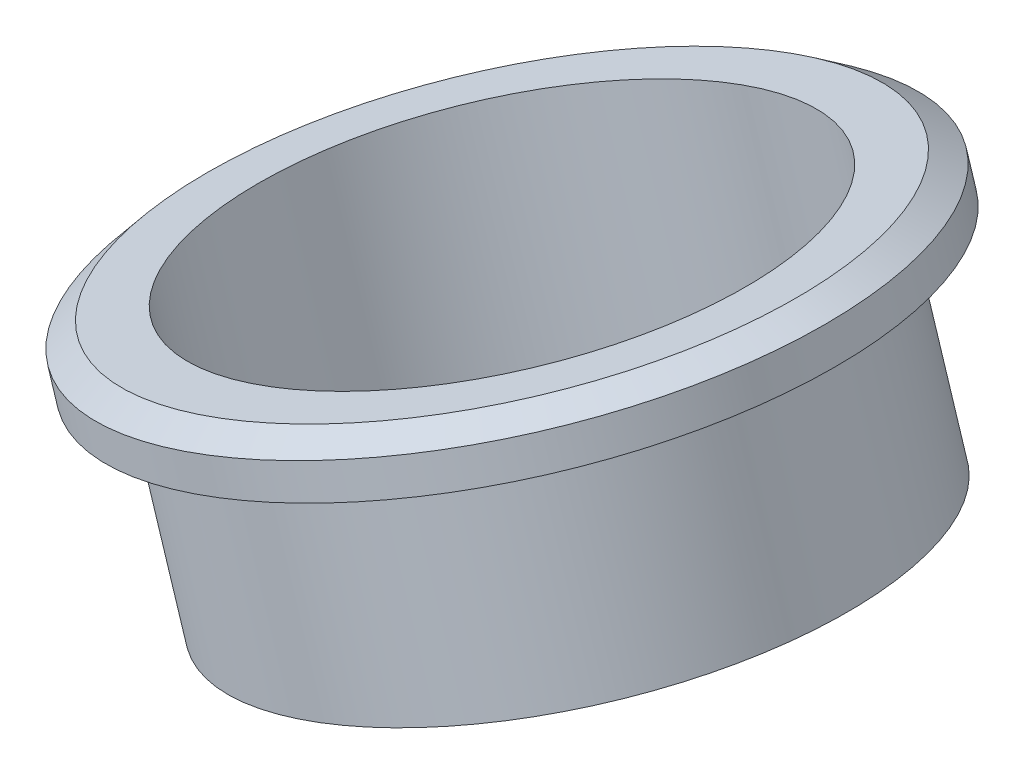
ISO-10303-21;
HEADER;
FILE_DESCRIPTION(('STEP AP214'),'2;1');
FILE_NAME('part.step','',(''),(''),'','','');
FILE_SCHEMA(('AUTOMOTIVE_DESIGN { 1 0 10303 214 1 1 1 1 }'));
ENDSEC;
DATA;
#1=APPLICATION_CONTEXT('core data for automotive mechanical design processes');
#2=APPLICATION_PROTOCOL_DEFINITION('international standard','automotive_design',2000,#1);
#3=PRODUCT_CONTEXT('',#1,'mechanical');
#4=PRODUCT('Part','Part','',(#3));
#5=PRODUCT_RELATED_PRODUCT_CATEGORY('part','',(#4));
#6=PRODUCT_DEFINITION_FORMATION('','',#4);
#7=PRODUCT_DEFINITION_CONTEXT('part definition',#1,'design');
#8=PRODUCT_DEFINITION('design','',#6,#7);
#9=PRODUCT_DEFINITION_SHAPE('','',#8);
#10=(LENGTH_UNIT() NAMED_UNIT(*) SI_UNIT(.MILLI.,.METRE.));
#11=(NAMED_UNIT(*) PLANE_ANGLE_UNIT() SI_UNIT($,.RADIAN.));
#12=(NAMED_UNIT(*) SI_UNIT($,.STERADIAN.) SOLID_ANGLE_UNIT());
#13=UNCERTAINTY_MEASURE_WITH_UNIT(LENGTH_MEASURE(1.E-05),#10,'distance_accuracy_value','');
#14=(GEOMETRIC_REPRESENTATION_CONTEXT(3) GLOBAL_UNCERTAINTY_ASSIGNED_CONTEXT((#13)) GLOBAL_UNIT_ASSIGNED_CONTEXT((#10,
#11,#12)) REPRESENTATION_CONTEXT('',''));
#15=CARTESIAN_POINT('',(0.,0.,0.));
#16=DIRECTION('',(0.,0.,1.));
#17=DIRECTION('',(1.,0.,0.));
#18=AXIS2_PLACEMENT_3D('',#15,#16,#17);
#19=CARTESIAN_POINT('',(364.894285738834,534.52971420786,0.));
#20=DIRECTION('',(-0.300714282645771,0.953714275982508,0.));
#21=DIRECTION('',(-0.953714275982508,-0.300714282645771,0.));
#22=AXIS2_PLACEMENT_3D('',#19,#20,#21);
#23=CYLINDRICAL_SURFACE('',#22,15.3);
#24=CARTESIAN_POINT('',(370.908571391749,515.45542868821,0.));
#25=DIRECTION('',(-0.300714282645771,0.953714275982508,0.));
#26=DIRECTION('',(-0.953714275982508,-0.300714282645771,0.));
#27=AXIS2_PLACEMENT_3D('',#24,#25,#26);
#28=CIRCLE('',#27,15.3);
#29=CARTESIAN_POINT('',(356.316742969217,510.85450016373,0.));
#30=VERTEX_POINT('',#29);
#31=EDGE_CURVE('E10',#30,#30,#28,.T.);
#32=ORIENTED_EDGE('',*,*,#31,.F.);
#33=EDGE_LOOP('',(#32));
#34=FACE_BOUND('',#33,.T.);
#35=CARTESIAN_POINT('',(366.397857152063,529.761142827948,0.));
#36=DIRECTION('',(-0.300714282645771,0.953714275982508,0.));
#37=DIRECTION('',(-0.953714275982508,-0.300714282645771,0.));
#38=AXIS2_PLACEMENT_3D('',#35,#36,#37);
#39=CIRCLE('',#38,15.3);
#40=CARTESIAN_POINT('',(351.80602872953,525.160214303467,0.));
#41=VERTEX_POINT('',#40);
#42=EDGE_CURVE('E57',#41,#41,#39,.T.);
#43=ORIENTED_EDGE('',*,*,#42,.T.);
#44=EDGE_LOOP('',(#43));
#45=FACE_BOUND('',#44,.T.);
#46=ADVANCED_FACE('F32',(#34,#45),#23,.F.);
#47=CARTESIAN_POINT('',(385.500399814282,520.05635721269,0.));
#48=DIRECTION('',(-0.300714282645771,0.953714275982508,0.));
#49=DIRECTION('',(-0.953714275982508,-0.300714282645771,0.));
#50=AXIS2_PLACEMENT_3D('',#47,#48,#49);
#51=PLANE('',#50);
#52=CARTESIAN_POINT('',(370.908571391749,515.45542868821,0.));
#53=DIRECTION('',(-0.300714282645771,0.953714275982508,0.));
#54=DIRECTION('',(-0.953714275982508,-0.300714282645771,0.));
#55=AXIS2_PLACEMENT_3D('',#52,#53,#54);
#56=CIRCLE('',#55,17.);
#57=CARTESIAN_POINT('',(354.695428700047,510.343285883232,0.));
#58=VERTEX_POINT('',#57);
#59=EDGE_CURVE('E38',#58,#58,#56,.T.);
#60=ORIENTED_EDGE('',*,*,#59,.F.);
#61=EDGE_LOOP('',(#60));
#62=FACE_BOUND('',#61,.T.);
#63=ORIENTED_EDGE('',*,*,#31,.T.);
#64=EDGE_LOOP('',(#63));
#65=FACE_BOUND('',#64,.T.);
#66=ADVANCED_FACE('F88',(#62,#65),#51,.F.);
#67=CARTESIAN_POINT('',(364.894285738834,534.52971420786,0.));
#68=DIRECTION('',(-0.300714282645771,0.953714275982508,0.));
#69=DIRECTION('',(-0.953714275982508,-0.300714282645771,0.));
#70=AXIS2_PLACEMENT_3D('',#67,#68,#69);
#71=CYLINDRICAL_SURFACE('',#70,17.);
#72=CARTESIAN_POINT('',(367.3,526.9,0.));
#73=DIRECTION('',(-0.300714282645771,0.953714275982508,0.));
#74=DIRECTION('',(-0.953714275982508,-0.300714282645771,0.));
#75=AXIS2_PLACEMENT_3D('',#72,#73,#74);
#76=CIRCLE('',#75,17.);
#77=CARTESIAN_POINT('',(351.086857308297,521.787857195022,0.));
#78=VERTEX_POINT('',#77);
#79=EDGE_CURVE('E42',#78,#78,#76,.T.);
#80=ORIENTED_EDGE('',*,*,#79,.F.);
#81=EDGE_LOOP('',(#80));
#82=FACE_BOUND('',#81,.T.);
#83=ORIENTED_EDGE('',*,*,#59,.T.);
#84=EDGE_LOOP('',(#83));
#85=FACE_BOUND('',#84,.T.);
#86=ADVANCED_FACE('F83',(#82,#85),#71,.T.);
#87=CARTESIAN_POINT('',(383.513142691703,532.012142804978,0.));
#88=DIRECTION('',(-0.300714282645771,0.953714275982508,0.));
#89=DIRECTION('',(-0.953714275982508,-0.300714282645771,0.));
#90=AXIS2_PLACEMENT_3D('',#87,#88,#89);
#91=PLANE('',#90);
#92=CARTESIAN_POINT('',(367.3,526.9,0.));
#93=DIRECTION('',(-0.300714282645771,0.953714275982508,0.));
#94=DIRECTION('',(-0.953714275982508,-0.300714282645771,0.));
#95=AXIS2_PLACEMENT_3D('',#92,#93,#94);
#96=CIRCLE('',#95,20.);
#97=CARTESIAN_POINT('',(348.22571448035,520.885714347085,0.));
#98=VERTEX_POINT('',#97);
#99=EDGE_CURVE('E46',#98,#98,#96,.T.);
#100=ORIENTED_EDGE('',*,*,#99,.F.);
#101=EDGE_LOOP('',(#100));
#102=FACE_BOUND('',#101,.T.);
#103=ORIENTED_EDGE('',*,*,#79,.T.);
#104=EDGE_LOOP('',(#103));
#105=FACE_BOUND('',#104,.T.);
#106=ADVANCED_FACE('F77',(#102,#105),#91,.F.);
#107=CARTESIAN_POINT('',(364.894285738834,534.52971420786,0.));
#108=DIRECTION('',(-0.300714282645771,0.953714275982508,0.));
#109=DIRECTION('',(-0.953714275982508,-0.300714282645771,0.));
#110=AXIS2_PLACEMENT_3D('',#107,#108,#109);
#111=CYLINDRICAL_SURFACE('',#110,20.);
#112=CARTESIAN_POINT('',(366.698571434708,528.807428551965,0.));
#113=DIRECTION('',(-0.300714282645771,0.953714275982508,0.));
#114=DIRECTION('',(-0.953714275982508,-0.300714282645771,0.));
#115=AXIS2_PLACEMENT_3D('',#112,#113,#114);
#116=CIRCLE('',#115,20.);
#117=CARTESIAN_POINT('',(347.624285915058,522.79314289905,0.));
#118=VERTEX_POINT('',#117);
#119=EDGE_CURVE('E51',#118,#118,#116,.T.);
#120=ORIENTED_EDGE('',*,*,#119,.F.);
#121=EDGE_LOOP('',(#120));
#122=FACE_BOUND('',#121,.T.);
#123=ORIENTED_EDGE('',*,*,#99,.T.);
#124=EDGE_LOOP('',(#123));
#125=FACE_BOUND('',#124,.T.);
#126=ADVANCED_FACE('F71',(#122,#125),#111,.T.);
#127=CARTESIAN_POINT('',(366.698571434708,528.807428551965,0.));
#128=DIRECTION('',(0.300714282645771,-0.953714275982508,0.));
#129=DIRECTION('',(0.953714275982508,0.300714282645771,0.));
#130=AXIS2_PLACEMENT_3D('',#127,#128,#129);
#131=CONICAL_SURFACE('',#130,20.,0.982793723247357);
#132=CARTESIAN_POINT('',(366.397857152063,529.761142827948,0.));
#133=DIRECTION('',(-0.300714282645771,0.953714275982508,0.));
#134=DIRECTION('',(-0.953714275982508,-0.300714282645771,0.));
#135=AXIS2_PLACEMENT_3D('',#132,#133,#134);
#136=CIRCLE('',#135,18.5);
#137=CARTESIAN_POINT('',(348.754143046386,524.197928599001,0.));
#138=VERTEX_POINT('',#137);
#139=EDGE_CURVE('E54',#138,#138,#136,.T.);
#140=ORIENTED_EDGE('',*,*,#139,.F.);
#141=EDGE_LOOP('',(#140));
#142=FACE_BOUND('',#141,.T.);
#143=ORIENTED_EDGE('',*,*,#119,.T.);
#144=EDGE_LOOP('',(#143));
#145=FACE_BOUND('',#144,.T.);
#146=ADVANCED_FACE('F65',(#142,#145),#131,.T.);
#147=CARTESIAN_POINT('',(384.041571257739,535.324357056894,0.));
#148=DIRECTION('',(0.300714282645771,-0.953714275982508,0.));
#149=DIRECTION('',(0.953714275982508,0.300714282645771,0.));
#150=AXIS2_PLACEMENT_3D('',#147,#148,#149);
#151=PLANE('',#150);
#152=ORIENTED_EDGE('',*,*,#42,.F.);
#153=EDGE_LOOP('',(#152));
#154=FACE_BOUND('',#153,.T.);
#155=ORIENTED_EDGE('',*,*,#139,.T.);
#156=EDGE_LOOP('',(#155));
#157=FACE_BOUND('',#156,.T.);
#158=ADVANCED_FACE('F62',(#154,#157),#151,.F.);
#159=CLOSED_SHELL('',(#46,#66,#86,#106,#126,#146,#158));
#160=MANIFOLD_SOLID_BREP('B2',#159);
#161=ADVANCED_BREP_SHAPE_REPRESENTATION('',(#18,#160),#14);
#162=SHAPE_DEFINITION_REPRESENTATION(#9,#161);
ENDSEC;
END-ISO-10303-21;
